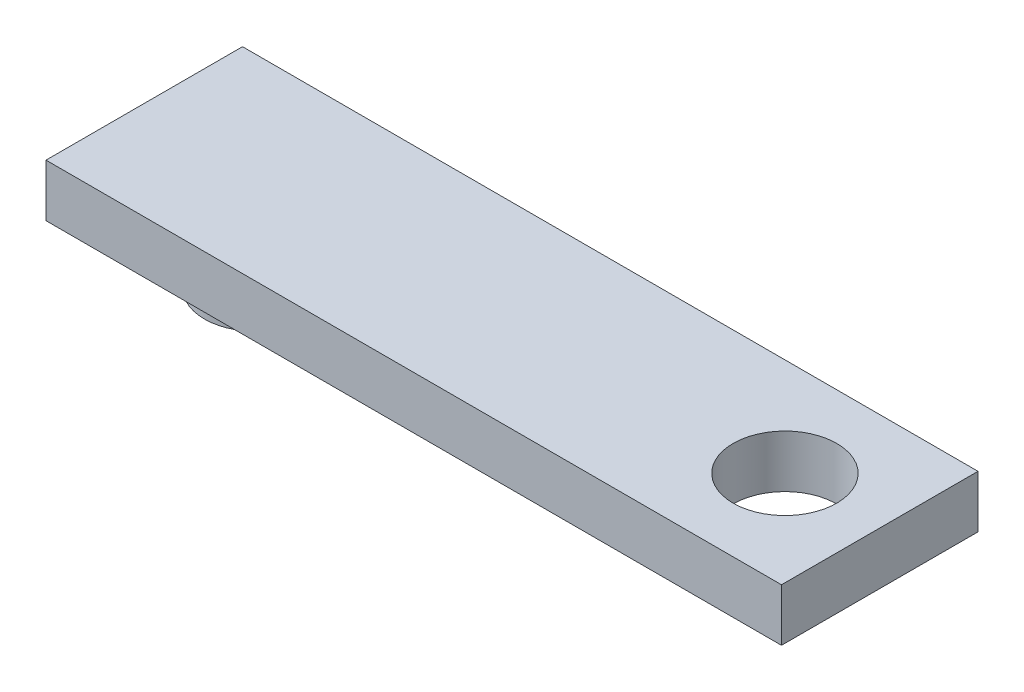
from build123d import *

# Parameters (mm, degrees)
SKIZZE1_R               = 9.869975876
LINEAR_AUSTRAGEN1_DEPTH = 10
SKIZZE2_W               = 140.19121229
SKIZZE2_H               = 37.457853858
LINEAR_AUSTRAGEN2_DEPTH = 10
SKIZZE3_R               = 9.869975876
LINEAR_AUSTRAGEN3_DEPTH = 10


with BuildPart() as part:
    # Skizze1 → Linear austragen1 (new body)
    with BuildSketch(Plane(origin=(0, 0, 0), x_dir=(1, 0, 0), z_dir=(0, 1, 0))):
        with Locations(Location((0, 0, 0), (0, 0, 270))):
            Circle(SKIZZE1_R)
    extrude(amount=LINEAR_AUSTRAGEN1_DEPTH)

    # Skizze2 → Linear austragen2 (add)
    with BuildSketch(Plane(origin=(0, 10, 0), x_dir=(1, 0, 0), z_dir=(0, 1, 0))):
        with Locations((48.756062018, 0)):
            Rectangle(SKIZZE2_W, SKIZZE2_H)
    extrude(amount=LINEAR_AUSTRAGEN2_DEPTH)

    # Skizze3 → Linear austragen3 (cut)
    with BuildSketch(Plane(origin=(0, 20, 0), x_dir=(1, 0, 0), z_dir=(0, 1, 0))):
        with Locations(Location((100.779697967, 0, 0), (0, 0, 270))):
            Circle(SKIZZE3_R)
    extrude(amount=-LINEAR_AUSTRAGEN3_DEPTH, mode=Mode.SUBTRACT)


solid = part.part
